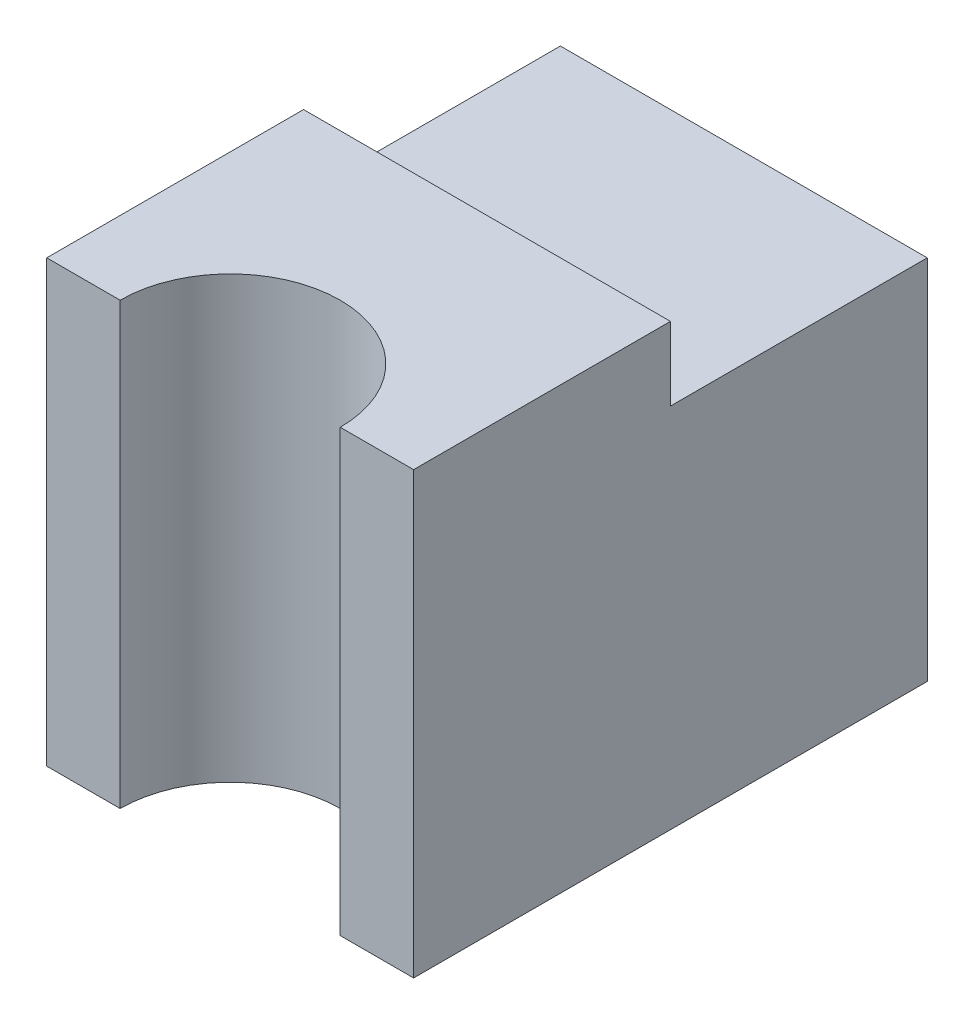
from build123d import *

# Parameters (mm, degrees)
SKETCH1_W           = 0.5
SKETCH1_H           = 0.7
BOSS_EXTRUDE1_DEPTH = 0.6
CUT_EXTRUDE1_REACH  = 3.049
SKETCH2_R           = 0.15
SKETCH3_W           = 0.5
SKETCH3_H           = 0.35
CUT_EXTRUDE2_DEPTH  = 0.1


with BuildPart() as part:
    # Sketch1 → Boss-Extrude1 (new body)
    with BuildSketch(Plane(origin=(0, 0, 0), x_dir=(1, 0, 0), z_dir=(0, 1, 0))):
        with Locations((0.25, 0.35)):
            Rectangle(SKETCH1_W, SKETCH1_H)
    extrude(amount=BOSS_EXTRUDE1_DEPTH)

    # Sketch2 → Cut-Extrude1 (cut, up to next)
    with BuildSketch(Plane(origin=(0, 0.6, 0), x_dir=(1, 0, 0), z_dir=(0, 1, 0)), mode=Mode.PRIVATE) as cut_extrude1_sk1:
        with Locations((0.25, 0)):
            Circle(SKETCH2_R)
    cut_extrude1_tool1 = extrude(cut_extrude1_sk1.sketch, amount=-CUT_EXTRUDE1_REACH, mode=Mode.PRIVATE) & part.part
    add(cut_extrude1_tool1.solids().sort_by_distance((0.25, 0.6, 0))[0], mode=Mode.SUBTRACT)

    # Sketch3 → Cut-Extrude2 (cut)
    with BuildSketch(Plane(origin=(0, 0.6, 0), x_dir=(1, 0, 0), z_dir=(0, 1, 0))):
        with Locations((0.25, 0.525)):
            Rectangle(SKETCH3_W, SKETCH3_H)
    extrude(amount=-CUT_EXTRUDE2_DEPTH, mode=Mode.SUBTRACT)


solid = part.part
